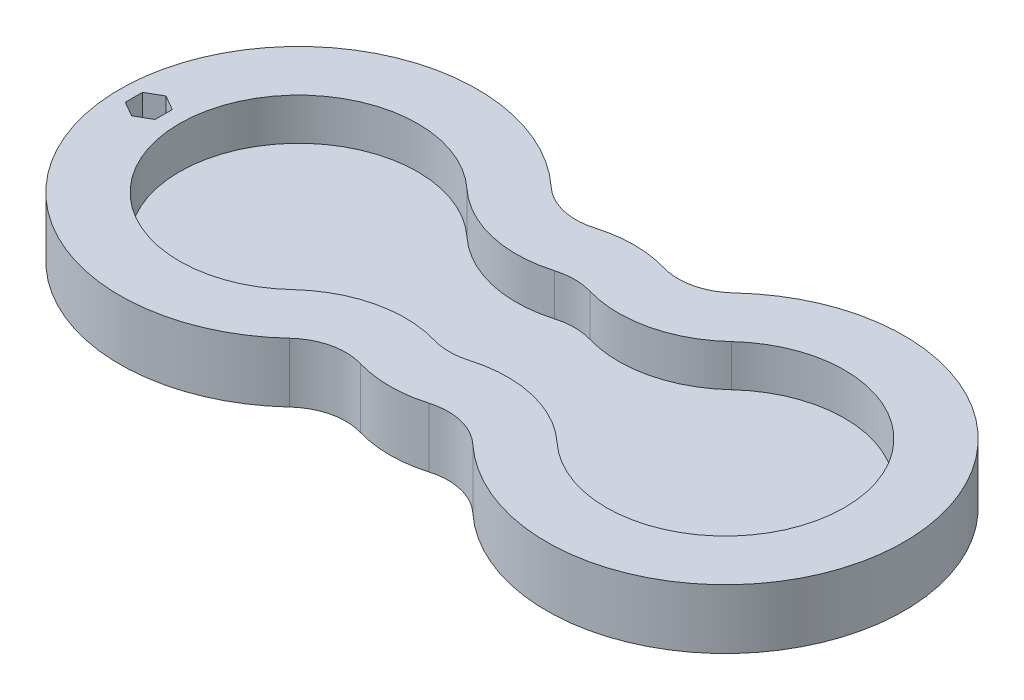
ISO-10303-21;
HEADER;
FILE_DESCRIPTION(('STEP AP214'),'2;1');
FILE_NAME('part.step','',(''),(''),'','','');
FILE_SCHEMA(('AUTOMOTIVE_DESIGN { 1 0 10303 214 1 1 1 1 }'));
ENDSEC;
DATA;
#1=APPLICATION_CONTEXT('core data for automotive mechanical design processes');
#2=APPLICATION_PROTOCOL_DEFINITION('international standard','automotive_design',2000,#1);
#3=PRODUCT_CONTEXT('',#1,'mechanical');
#4=PRODUCT('Part','Part','',(#3));
#5=PRODUCT_RELATED_PRODUCT_CATEGORY('part','',(#4));
#6=PRODUCT_DEFINITION_FORMATION('','',#4);
#7=PRODUCT_DEFINITION_CONTEXT('part definition',#1,'design');
#8=PRODUCT_DEFINITION('design','',#6,#7);
#9=PRODUCT_DEFINITION_SHAPE('','',#8);
#10=(LENGTH_UNIT() NAMED_UNIT(*) SI_UNIT(.MILLI.,.METRE.));
#11=(NAMED_UNIT(*) PLANE_ANGLE_UNIT() SI_UNIT($,.RADIAN.));
#12=(NAMED_UNIT(*) SI_UNIT($,.STERADIAN.) SOLID_ANGLE_UNIT());
#13=UNCERTAINTY_MEASURE_WITH_UNIT(LENGTH_MEASURE(1.E-05),#10,'distance_accuracy_value','');
#14=(GEOMETRIC_REPRESENTATION_CONTEXT(3) GLOBAL_UNCERTAINTY_ASSIGNED_CONTEXT((#13)) GLOBAL_UNIT_ASSIGNED_CONTEXT((#10,
#11,#12)) REPRESENTATION_CONTEXT('',''));
#15=CARTESIAN_POINT('',(0.,0.,0.));
#16=DIRECTION('',(0.,0.,1.));
#17=DIRECTION('',(1.,0.,0.));
#18=AXIS2_PLACEMENT_3D('',#15,#16,#17);
#19=CARTESIAN_POINT('',(-10.8927391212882,12.7,-37.193302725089));
#20=DIRECTION('',(0.,-1.,0.));
#21=DIRECTION('',(0.,0.,-1.));
#22=AXIS2_PLACEMENT_3D('',#19,#20,#21);
#23=CYLINDRICAL_SURFACE('',#22,12.7);
#24=CARTESIAN_POINT('',(-10.8927391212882,0.,-37.193302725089));
#25=DIRECTION('',(0.,-1.,0.));
#26=DIRECTION('',(0.,0.,-1.));
#27=AXIS2_PLACEMENT_3D('',#24,#25,#26);
#28=CIRCLE('',#27,12.7);
#29=CARTESIAN_POINT('',(-7.32324400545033,0.,-25.0052469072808));
#30=VERTEX_POINT('',#29);
#31=CARTESIAN_POINT('',(-19.5412716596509,0.,-27.893147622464));
#32=VERTEX_POINT('',#31);
#33=EDGE_CURVE('E282',#30,#32,#28,.T.);
#34=ORIENTED_EDGE('',*,*,#33,.T.);
#35=DIRECTION('',(0.,-1.,0.));
#36=VECTOR('',#35,1.);
#37=CARTESIAN_POINT('',(-19.5412716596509,12.7,-27.893147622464));
#38=LINE('',#37,#36);
#39=CARTESIAN_POINT('',(-19.5412716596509,12.7,-27.893147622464));
#40=VERTEX_POINT('',#39);
#41=EDGE_CURVE('E11',#40,#32,#38,.T.);
#42=ORIENTED_EDGE('',*,*,#41,.F.);
#43=CARTESIAN_POINT('',(-10.8927391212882,12.7,-37.193302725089));
#44=DIRECTION('',(0.,-1.,0.));
#45=DIRECTION('',(0.,0.,-1.));
#46=AXIS2_PLACEMENT_3D('',#43,#44,#45);
#47=CIRCLE('',#46,12.7);
#48=CARTESIAN_POINT('',(-7.32324400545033,12.7,-25.0052469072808));
#49=VERTEX_POINT('',#48);
#50=EDGE_CURVE('E296',#49,#40,#47,.T.);
#51=ORIENTED_EDGE('',*,*,#50,.F.);
#52=DIRECTION('',(0.,-1.,0.));
#53=VECTOR('',#52,1.);
#54=CARTESIAN_POINT('',(-7.32324400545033,12.7,-25.0052469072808));
#55=LINE('',#54,#53);
#56=EDGE_CURVE('E314',#49,#30,#55,.T.);
#57=ORIENTED_EDGE('',*,*,#56,.T.);
#58=EDGE_LOOP('',(#34,#42,#51,#57));
#59=FACE_BOUND('',#58,.T.);
#60=ADVANCED_FACE('F31',(#59),#23,.F.);
#61=CARTESIAN_POINT('',(-45.4800643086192,12.7,0.));
#62=DIRECTION('',(0.,-1.,0.));
#63=DIRECTION('',(0.,0.,-1.));
#64=AXIS2_PLACEMENT_3D('',#61,#62,#63);
#65=CYLINDRICAL_SURFACE('',#64,38.0900071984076);
#66=CARTESIAN_POINT('',(-45.4800643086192,0.,0.));
#67=DIRECTION('',(0.,1.,0.));
#68=DIRECTION('',(0.,0.,-1.));
#69=AXIS2_PLACEMENT_3D('',#66,#67,#68);
#70=CIRCLE('',#69,38.0900071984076);
#71=CARTESIAN_POINT('',(-19.5412716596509,0.,27.893147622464));
#72=VERTEX_POINT('',#71);
#73=EDGE_CURVE('E317',#32,#72,#70,.T.);
#74=ORIENTED_EDGE('',*,*,#73,.T.);
#75=DIRECTION('',(0.,-1.,0.));
#76=VECTOR('',#75,1.);
#77=CARTESIAN_POINT('',(-19.5412716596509,12.7,27.893147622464));
#78=LINE('',#77,#76);
#79=CARTESIAN_POINT('',(-19.5412716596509,12.7,27.893147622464));
#80=VERTEX_POINT('',#79);
#81=EDGE_CURVE('E38',#80,#72,#78,.T.);
#82=ORIENTED_EDGE('',*,*,#81,.F.);
#83=CARTESIAN_POINT('',(-45.4800643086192,12.7,0.));
#84=DIRECTION('',(0.,1.,0.));
#85=DIRECTION('',(0.,0.,-1.));
#86=AXIS2_PLACEMENT_3D('',#83,#84,#85);
#87=CIRCLE('',#86,38.0900071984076);
#88=EDGE_CURVE('E299',#40,#80,#87,.T.);
#89=ORIENTED_EDGE('',*,*,#88,.F.);
#90=ORIENTED_EDGE('',*,*,#41,.T.);
#91=EDGE_LOOP('',(#74,#82,#89,#90));
#92=FACE_BOUND('',#91,.T.);
#93=ADVANCED_FACE('F374',(#92),#65,.T.);
#94=CARTESIAN_POINT('',(-10.8927391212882,12.7,37.193302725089));
#95=DIRECTION('',(0.,-1.,0.));
#96=DIRECTION('',(0.,0.,-1.));
#97=AXIS2_PLACEMENT_3D('',#94,#95,#96);
#98=CYLINDRICAL_SURFACE('',#97,12.7);
#99=CARTESIAN_POINT('',(-10.8927391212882,0.,37.193302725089));
#100=DIRECTION('',(0.,-1.,0.));
#101=DIRECTION('',(0.,0.,1.));
#102=AXIS2_PLACEMENT_3D('',#99,#100,#101);
#103=CIRCLE('',#102,12.7);
#104=CARTESIAN_POINT('',(-7.32324400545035,0.,25.0052469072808));
#105=VERTEX_POINT('',#104);
#106=EDGE_CURVE('E319',#72,#105,#103,.T.);
#107=ORIENTED_EDGE('',*,*,#106,.T.);
#108=DIRECTION('',(0.,-1.,0.));
#109=VECTOR('',#108,1.);
#110=CARTESIAN_POINT('',(-7.32324400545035,12.7,25.0052469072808));
#111=LINE('',#110,#109);
#112=CARTESIAN_POINT('',(-7.32324400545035,12.7,25.0052469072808));
#113=VERTEX_POINT('',#112);
#114=EDGE_CURVE('E344',#113,#105,#111,.T.);
#115=ORIENTED_EDGE('',*,*,#114,.F.);
#116=CARTESIAN_POINT('',(-10.8927391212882,12.7,37.193302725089));
#117=DIRECTION('',(0.,-1.,0.));
#118=DIRECTION('',(0.,0.,1.));
#119=AXIS2_PLACEMENT_3D('',#116,#117,#118);
#120=CIRCLE('',#119,12.7);
#121=EDGE_CURVE('E302',#80,#113,#120,.T.);
#122=ORIENTED_EDGE('',*,*,#121,.F.);
#123=ORIENTED_EDGE('',*,*,#81,.T.);
#124=EDGE_LOOP('',(#107,#115,#122,#123));
#125=FACE_BOUND('',#124,.T.);
#126=ADVANCED_FACE('F351',(#125),#98,.F.);
#127=CARTESIAN_POINT('',(0.,12.7,0.));
#128=DIRECTION('',(0.,-1.,0.));
#129=DIRECTION('',(0.,0.,-1.));
#130=AXIS2_PLACEMENT_3D('',#127,#128,#129);
#131=CYLINDRICAL_SURFACE('',#130,26.0555613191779);
#132=CARTESIAN_POINT('',(0.,0.,0.));
#133=DIRECTION('',(0.,1.,0.));
#134=DIRECTION('',(0.,0.,1.));
#135=AXIS2_PLACEMENT_3D('',#132,#133,#134);
#136=CIRCLE('',#135,26.0555613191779);
#137=CARTESIAN_POINT('',(7.32324400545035,0.,25.0052469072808));
#138=VERTEX_POINT('',#137);
#139=EDGE_CURVE('E321',#105,#138,#136,.T.);
#140=ORIENTED_EDGE('',*,*,#139,.T.);
#141=DIRECTION('',(0.,-1.,0.));
#142=VECTOR('',#141,1.);
#143=CARTESIAN_POINT('',(7.32324400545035,12.7,25.0052469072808));
#144=LINE('',#143,#142);
#145=CARTESIAN_POINT('',(7.32324400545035,12.7,25.0052469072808));
#146=VERTEX_POINT('',#145);
#147=EDGE_CURVE('E341',#146,#138,#144,.T.);
#148=ORIENTED_EDGE('',*,*,#147,.F.);
#149=CARTESIAN_POINT('',(0.,12.7,0.));
#150=DIRECTION('',(0.,1.,0.));
#151=DIRECTION('',(0.,0.,1.));
#152=AXIS2_PLACEMENT_3D('',#149,#150,#151);
#153=CIRCLE('',#152,26.0555613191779);
#154=EDGE_CURVE('E304',#113,#146,#153,.T.);
#155=ORIENTED_EDGE('',*,*,#154,.F.);
#156=ORIENTED_EDGE('',*,*,#114,.T.);
#157=EDGE_LOOP('',(#140,#148,#155,#156));
#158=FACE_BOUND('',#157,.T.);
#159=ADVANCED_FACE('F362',(#158),#131,.T.);
#160=CARTESIAN_POINT('',(10.8927391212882,12.7,37.193302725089));
#161=DIRECTION('',(0.,-1.,0.));
#162=DIRECTION('',(0.,0.,-1.));
#163=AXIS2_PLACEMENT_3D('',#160,#161,#162);
#164=CYLINDRICAL_SURFACE('',#163,12.7);
#165=CARTESIAN_POINT('',(10.8927391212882,0.,37.193302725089));
#166=DIRECTION('',(0.,-1.,0.));
#167=DIRECTION('',(0.,0.,1.));
#168=AXIS2_PLACEMENT_3D('',#165,#166,#167);
#169=CIRCLE('',#168,12.7);
#170=CARTESIAN_POINT('',(19.5412716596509,0.,27.893147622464));
#171=VERTEX_POINT('',#170);
#172=EDGE_CURVE('E323',#138,#171,#169,.T.);
#173=ORIENTED_EDGE('',*,*,#172,.T.);
#174=DIRECTION('',(0.,-1.,0.));
#175=VECTOR('',#174,1.);
#176=CARTESIAN_POINT('',(19.5412716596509,12.7,27.893147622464));
#177=LINE('',#176,#175);
#178=CARTESIAN_POINT('',(19.5412716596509,12.7,27.893147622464));
#179=VERTEX_POINT('',#178);
#180=EDGE_CURVE('E338',#179,#171,#177,.T.);
#181=ORIENTED_EDGE('',*,*,#180,.F.);
#182=CARTESIAN_POINT('',(10.8927391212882,12.7,37.193302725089));
#183=DIRECTION('',(0.,-1.,0.));
#184=DIRECTION('',(0.,0.,1.));
#185=AXIS2_PLACEMENT_3D('',#182,#183,#184);
#186=CIRCLE('',#185,12.7);
#187=EDGE_CURVE('E306',#146,#179,#186,.T.);
#188=ORIENTED_EDGE('',*,*,#187,.F.);
#189=ORIENTED_EDGE('',*,*,#147,.T.);
#190=EDGE_LOOP('',(#173,#181,#188,#189));
#191=FACE_BOUND('',#190,.T.);
#192=ADVANCED_FACE('F366',(#191),#164,.F.);
#193=CARTESIAN_POINT('',(45.4800643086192,12.7,0.));
#194=DIRECTION('',(0.,-1.,0.));
#195=DIRECTION('',(0.,0.,-1.));
#196=AXIS2_PLACEMENT_3D('',#193,#194,#195);
#197=CYLINDRICAL_SURFACE('',#196,38.0900071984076);
#198=CARTESIAN_POINT('',(45.4800643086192,0.,0.));
#199=DIRECTION('',(0.,1.,0.));
#200=DIRECTION('',(0.,0.,1.));
#201=AXIS2_PLACEMENT_3D('',#198,#199,#200);
#202=CIRCLE('',#201,38.0900071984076);
#203=CARTESIAN_POINT('',(19.5412716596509,0.,-27.893147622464));
#204=VERTEX_POINT('',#203);
#205=EDGE_CURVE('E325',#171,#204,#202,.T.);
#206=ORIENTED_EDGE('',*,*,#205,.T.);
#207=DIRECTION('',(0.,-1.,0.));
#208=VECTOR('',#207,1.);
#209=CARTESIAN_POINT('',(19.5412716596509,12.7,-27.893147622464));
#210=LINE('',#209,#208);
#211=CARTESIAN_POINT('',(19.5412716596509,12.7,-27.893147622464));
#212=VERTEX_POINT('',#211);
#213=EDGE_CURVE('E335',#212,#204,#210,.T.);
#214=ORIENTED_EDGE('',*,*,#213,.F.);
#215=CARTESIAN_POINT('',(45.4800643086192,12.7,0.));
#216=DIRECTION('',(0.,1.,0.));
#217=DIRECTION('',(0.,0.,1.));
#218=AXIS2_PLACEMENT_3D('',#215,#216,#217);
#219=CIRCLE('',#218,38.0900071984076);
#220=EDGE_CURVE('E308',#179,#212,#219,.T.);
#221=ORIENTED_EDGE('',*,*,#220,.F.);
#222=ORIENTED_EDGE('',*,*,#180,.T.);
#223=EDGE_LOOP('',(#206,#214,#221,#222));
#224=FACE_BOUND('',#223,.T.);
#225=ADVANCED_FACE('F387',(#224),#197,.T.);
#226=CARTESIAN_POINT('',(10.8927391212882,12.7,-37.193302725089));
#227=DIRECTION('',(0.,-1.,0.));
#228=DIRECTION('',(0.,0.,-1.));
#229=AXIS2_PLACEMENT_3D('',#226,#227,#228);
#230=CYLINDRICAL_SURFACE('',#229,12.7);
#231=CARTESIAN_POINT('',(10.8927391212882,0.,-37.193302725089));
#232=DIRECTION('',(0.,-1.,0.));
#233=DIRECTION('',(0.,0.,-1.));
#234=AXIS2_PLACEMENT_3D('',#231,#232,#233);
#235=CIRCLE('',#234,12.7);
#236=CARTESIAN_POINT('',(7.32324400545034,0.,-25.0052469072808));
#237=VERTEX_POINT('',#236);
#238=EDGE_CURVE('E327',#204,#237,#235,.T.);
#239=ORIENTED_EDGE('',*,*,#238,.T.);
#240=DIRECTION('',(0.,-1.,0.));
#241=VECTOR('',#240,1.);
#242=CARTESIAN_POINT('',(7.32324400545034,12.7,-25.0052469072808));
#243=LINE('',#242,#241);
#244=CARTESIAN_POINT('',(7.32324400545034,12.7,-25.0052469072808));
#245=VERTEX_POINT('',#244);
#246=EDGE_CURVE('E332',#245,#237,#243,.T.);
#247=ORIENTED_EDGE('',*,*,#246,.F.);
#248=CARTESIAN_POINT('',(10.8927391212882,12.7,-37.193302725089));
#249=DIRECTION('',(0.,-1.,0.));
#250=DIRECTION('',(0.,0.,-1.));
#251=AXIS2_PLACEMENT_3D('',#248,#249,#250);
#252=CIRCLE('',#251,12.7);
#253=EDGE_CURVE('E310',#212,#245,#252,.T.);
#254=ORIENTED_EDGE('',*,*,#253,.F.);
#255=ORIENTED_EDGE('',*,*,#213,.T.);
#256=EDGE_LOOP('',(#239,#247,#254,#255));
#257=FACE_BOUND('',#256,.T.);
#258=ADVANCED_FACE('F385',(#257),#230,.F.);
#259=CARTESIAN_POINT('',(0.,12.7,0.));
#260=DIRECTION('',(0.,-1.,0.));
#261=DIRECTION('',(0.,0.,-1.));
#262=AXIS2_PLACEMENT_3D('',#259,#260,#261);
#263=CYLINDRICAL_SURFACE('',#262,26.0555613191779);
#264=CARTESIAN_POINT('',(0.,0.,0.));
#265=DIRECTION('',(0.,1.,0.));
#266=DIRECTION('',(0.,0.,1.));
#267=AXIS2_PLACEMENT_3D('',#264,#265,#266);
#268=CIRCLE('',#267,26.0555613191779);
#269=EDGE_CURVE('E300',#237,#30,#268,.T.);
#270=ORIENTED_EDGE('',*,*,#269,.T.);
#271=ORIENTED_EDGE('',*,*,#56,.F.);
#272=CARTESIAN_POINT('',(0.,12.7,0.));
#273=DIRECTION('',(0.,1.,0.));
#274=DIRECTION('',(0.,0.,1.));
#275=AXIS2_PLACEMENT_3D('',#272,#273,#274);
#276=CIRCLE('',#275,26.0555613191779);
#277=EDGE_CURVE('E312',#245,#49,#276,.T.);
#278=ORIENTED_EDGE('',*,*,#277,.F.);
#279=ORIENTED_EDGE('',*,*,#246,.T.);
#280=EDGE_LOOP('',(#270,#271,#278,#279));
#281=FACE_BOUND('',#280,.T.);
#282=ADVANCED_FACE('F380',(#281),#263,.T.);
#283=CARTESIAN_POINT('',(-28.1864017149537,12.7,-18.5966513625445));
#284=DIRECTION('',(0.,-1.,0.));
#285=DIRECTION('',(0.,0.,-1.));
#286=AXIS2_PLACEMENT_3D('',#283,#284,#285);
#287=PLANE('',#286);
#288=DIRECTION('',(-0.866025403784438,0.,0.500000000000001));
#289=VECTOR('',#288,1.);
#290=CARTESIAN_POINT('',(-77.3964338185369,12.7,-3.66617420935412));
#291=LINE('',#290,#289);
#292=CARTESIAN_POINT('',(-77.3964338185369,12.7,-3.66617420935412));
#293=VERTEX_POINT('',#292);
#294=CARTESIAN_POINT('',(-80.5714338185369,12.7,-1.83308710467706));
#295=VERTEX_POINT('',#294);
#296=EDGE_CURVE('E214',#293,#295,#291,.T.);
#297=ORIENTED_EDGE('',*,*,#296,.F.);
#298=DIRECTION('',(-0.866025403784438,0.,-0.500000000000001));
#299=VECTOR('',#298,1.);
#300=CARTESIAN_POINT('',(-74.221433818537,12.7,-1.83308710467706));
#301=LINE('',#300,#299);
#302=CARTESIAN_POINT('',(-74.221433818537,12.7,-1.83308710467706));
#303=VERTEX_POINT('',#302);
#304=EDGE_CURVE('E45',#303,#293,#301,.T.);
#305=ORIENTED_EDGE('',*,*,#304,.F.);
#306=DIRECTION('',(0.,0.,-1.));
#307=VECTOR('',#306,1.);
#308=CARTESIAN_POINT('',(-74.221433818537,12.7,1.83308710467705));
#309=LINE('',#308,#307);
#310=CARTESIAN_POINT('',(-74.221433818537,12.7,1.83308710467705));
#311=VERTEX_POINT('',#310);
#312=EDGE_CURVE('E200',#311,#303,#309,.T.);
#313=ORIENTED_EDGE('',*,*,#312,.F.);
#314=DIRECTION('',(0.866025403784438,0.,-0.500000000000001));
#315=VECTOR('',#314,1.);
#316=CARTESIAN_POINT('',(-77.396433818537,12.7,3.66617420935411));
#317=LINE('',#316,#315);
#318=CARTESIAN_POINT('',(-77.396433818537,12.7,3.66617420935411));
#319=VERTEX_POINT('',#318);
#320=EDGE_CURVE('E203',#319,#311,#317,.T.);
#321=ORIENTED_EDGE('',*,*,#320,.F.);
#322=DIRECTION('',(0.866025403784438,0.,0.500000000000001));
#323=VECTOR('',#322,1.);
#324=CARTESIAN_POINT('',(-80.5714338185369,12.7,1.83308710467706));
#325=LINE('',#324,#323);
#326=CARTESIAN_POINT('',(-80.5714338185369,12.7,1.83308710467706));
#327=VERTEX_POINT('',#326);
#328=EDGE_CURVE('E219',#327,#319,#325,.T.);
#329=ORIENTED_EDGE('',*,*,#328,.F.);
#330=DIRECTION('',(0.,0.,1.));
#331=VECTOR('',#330,1.);
#332=CARTESIAN_POINT('',(-80.5714338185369,12.7,-1.83308710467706));
#333=LINE('',#332,#331);
#334=EDGE_CURVE('E216',#295,#327,#333,.T.);
#335=ORIENTED_EDGE('',*,*,#334,.F.);
#336=EDGE_LOOP('',(#297,#305,#313,#321,#329,#335));
#337=FACE_BOUND('',#336,.T.);
#338=CARTESIAN_POINT('',(-10.8927391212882,12.7,37.193302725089));
#339=DIRECTION('',(0.,-1.,0.));
#340=DIRECTION('',(0.,0.,1.));
#341=AXIS2_PLACEMENT_3D('',#338,#339,#340);
#342=CIRCLE('',#341,25.4);
#343=CARTESIAN_POINT('',(-28.1898041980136,12.7,18.592992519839));
#344=VERTEX_POINT('',#343);
#345=CARTESIAN_POINT('',(-3.7537488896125,12.7,12.8171910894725));
#346=VERTEX_POINT('',#345);
#347=EDGE_CURVE('E260',#344,#346,#342,.T.);
#348=ORIENTED_EDGE('',*,*,#347,.F.);
#349=CARTESIAN_POINT('',(-45.4800643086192,12.7,0.));
#350=DIRECTION('',(0.,1.,0.));
#351=DIRECTION('',(0.,0.,1.));
#352=AXIS2_PLACEMENT_3D('',#349,#350,#351);
#353=CIRCLE('',#352,25.3900071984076);
#354=CARTESIAN_POINT('',(-28.1898041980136,12.7,-18.5929925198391));
#355=VERTEX_POINT('',#354);
#356=EDGE_CURVE('E53',#355,#344,#353,.T.);
#357=ORIENTED_EDGE('',*,*,#356,.F.);
#358=CARTESIAN_POINT('',(-10.8927391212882,12.7,-37.193302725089));
#359=DIRECTION('',(0.,-1.,0.));
#360=DIRECTION('',(0.,0.,1.));
#361=AXIS2_PLACEMENT_3D('',#358,#359,#360);
#362=CIRCLE('',#361,25.4);
#363=CARTESIAN_POINT('',(-3.75374888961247,12.7,-12.8171910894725));
#364=VERTEX_POINT('',#363);
#365=EDGE_CURVE('E237',#364,#355,#362,.T.);
#366=ORIENTED_EDGE('',*,*,#365,.F.);
#367=CARTESIAN_POINT('',(0.,12.7,0.));
#368=DIRECTION('',(0.,1.,0.));
#369=DIRECTION('',(0.,0.,1.));
#370=AXIS2_PLACEMENT_3D('',#367,#368,#369);
#371=CIRCLE('',#370,13.3555613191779);
#372=CARTESIAN_POINT('',(3.75374888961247,12.7,-12.8171910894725));
#373=VERTEX_POINT('',#372);
#374=EDGE_CURVE('E275',#373,#364,#371,.T.);
#375=ORIENTED_EDGE('',*,*,#374,.F.);
#376=CARTESIAN_POINT('',(10.8927391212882,12.7,-37.193302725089));
#377=DIRECTION('',(0.,-1.,0.));
#378=DIRECTION('',(0.,0.,1.));
#379=AXIS2_PLACEMENT_3D('',#376,#377,#378);
#380=CIRCLE('',#379,25.4);
#381=CARTESIAN_POINT('',(28.1898041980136,12.7,-18.592992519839));
#382=VERTEX_POINT('',#381);
#383=EDGE_CURVE('E272',#382,#373,#380,.T.);
#384=ORIENTED_EDGE('',*,*,#383,.F.);
#385=CARTESIAN_POINT('',(45.4800643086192,12.7,0.));
#386=DIRECTION('',(0.,1.,0.));
#387=DIRECTION('',(0.,0.,1.));
#388=AXIS2_PLACEMENT_3D('',#385,#386,#387);
#389=CIRCLE('',#388,25.3900071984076);
#390=CARTESIAN_POINT('',(28.1898041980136,12.7,18.592992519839));
#391=VERTEX_POINT('',#390);
#392=EDGE_CURVE('E269',#391,#382,#389,.T.);
#393=ORIENTED_EDGE('',*,*,#392,.F.);
#394=CARTESIAN_POINT('',(10.8927391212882,12.7,37.193302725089));
#395=DIRECTION('',(0.,-1.,0.));
#396=DIRECTION('',(0.,0.,1.));
#397=AXIS2_PLACEMENT_3D('',#394,#395,#396);
#398=CIRCLE('',#397,25.4);
#399=CARTESIAN_POINT('',(3.75374888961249,12.7,12.8171910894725));
#400=VERTEX_POINT('',#399);
#401=EDGE_CURVE('E266',#400,#391,#398,.T.);
#402=ORIENTED_EDGE('',*,*,#401,.F.);
#403=CARTESIAN_POINT('',(0.,12.7,0.));
#404=DIRECTION('',(0.,1.,0.));
#405=DIRECTION('',(0.,0.,1.));
#406=AXIS2_PLACEMENT_3D('',#403,#404,#405);
#407=CIRCLE('',#406,13.3555613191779);
#408=EDGE_CURVE('E263',#346,#400,#407,.T.);
#409=ORIENTED_EDGE('',*,*,#408,.F.);
#410=EDGE_LOOP('',(#348,#357,#366,#375,#384,#393,#402,#409));
#411=FACE_BOUND('',#410,.T.);
#412=ORIENTED_EDGE('',*,*,#50,.T.);
#413=ORIENTED_EDGE('',*,*,#88,.T.);
#414=ORIENTED_EDGE('',*,*,#121,.T.);
#415=ORIENTED_EDGE('',*,*,#154,.T.);
#416=ORIENTED_EDGE('',*,*,#187,.T.);
#417=ORIENTED_EDGE('',*,*,#220,.T.);
#418=ORIENTED_EDGE('',*,*,#253,.T.);
#419=ORIENTED_EDGE('',*,*,#277,.T.);
#420=EDGE_LOOP('',(#412,#413,#414,#415,#416,#417,#418,#419));
#421=FACE_BOUND('',#420,.T.);
#422=ADVANCED_FACE('F370',(#337,#411,#421),#287,.F.);
#423=CARTESIAN_POINT('',(-28.1864017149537,0.,-18.5966513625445));
#424=DIRECTION('',(0.,-1.,0.));
#425=DIRECTION('',(0.,0.,-1.));
#426=AXIS2_PLACEMENT_3D('',#423,#424,#425);
#427=PLANE('',#426);
#428=ORIENTED_EDGE('',*,*,#33,.F.);
#429=ORIENTED_EDGE('',*,*,#269,.F.);
#430=ORIENTED_EDGE('',*,*,#238,.F.);
#431=ORIENTED_EDGE('',*,*,#205,.F.);
#432=ORIENTED_EDGE('',*,*,#172,.F.);
#433=ORIENTED_EDGE('',*,*,#139,.F.);
#434=ORIENTED_EDGE('',*,*,#106,.F.);
#435=ORIENTED_EDGE('',*,*,#73,.F.);
#436=EDGE_LOOP('',(#428,#429,#430,#431,#432,#433,#434,#435));
#437=FACE_BOUND('',#436,.T.);
#438=ADVANCED_FACE('F357',(#437),#427,.T.);
#439=CARTESIAN_POINT('',(-45.4800643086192,3.81,0.));
#440=DIRECTION('',(0.,1.,0.));
#441=DIRECTION('',(0.,0.,1.));
#442=AXIS2_PLACEMENT_3D('',#439,#440,#441);
#443=CYLINDRICAL_SURFACE('',#442,25.3900071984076);
#444=ORIENTED_EDGE('',*,*,#356,.T.);
#445=DIRECTION('',(0.,1.,0.));
#446=VECTOR('',#445,1.);
#447=CARTESIAN_POINT('',(-28.1898041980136,3.81,18.592992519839));
#448=LINE('',#447,#446);
#449=CARTESIAN_POINT('',(-28.1898041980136,3.81,18.592992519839));
#450=VERTEX_POINT('',#449);
#451=EDGE_CURVE('E258',#450,#344,#448,.T.);
#452=ORIENTED_EDGE('',*,*,#451,.F.);
#453=CARTESIAN_POINT('',(-45.4800643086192,3.81,0.));
#454=DIRECTION('',(0.,1.,0.));
#455=DIRECTION('',(0.,0.,1.));
#456=AXIS2_PLACEMENT_3D('',#453,#454,#455);
#457=CIRCLE('',#456,25.3900071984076);
#458=CARTESIAN_POINT('',(-28.1898041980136,3.81,-18.5929925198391));
#459=VERTEX_POINT('',#458);
#460=EDGE_CURVE('E233',#459,#450,#457,.T.);
#461=ORIENTED_EDGE('',*,*,#460,.F.);
#462=DIRECTION('',(0.,1.,0.));
#463=VECTOR('',#462,1.);
#464=CARTESIAN_POINT('',(-28.1898041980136,3.81,-18.5929925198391));
#465=LINE('',#464,#463);
#466=EDGE_CURVE('E280',#459,#355,#465,.T.);
#467=ORIENTED_EDGE('',*,*,#466,.T.);
#468=EDGE_LOOP('',(#444,#452,#461,#467));
#469=FACE_BOUND('',#468,.T.);
#470=ADVANCED_FACE('F443',(#469),#443,.F.);
#471=CARTESIAN_POINT('',(-10.8927391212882,3.81,-37.193302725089));
#472=DIRECTION('',(0.,1.,0.));
#473=DIRECTION('',(0.,0.,1.));
#474=AXIS2_PLACEMENT_3D('',#471,#472,#473);
#475=CYLINDRICAL_SURFACE('',#474,25.4);
#476=ORIENTED_EDGE('',*,*,#365,.T.);
#477=ORIENTED_EDGE('',*,*,#466,.F.);
#478=CARTESIAN_POINT('',(-10.8927391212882,3.81,-37.193302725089));
#479=DIRECTION('',(0.,-1.,0.));
#480=DIRECTION('',(0.,0.,1.));
#481=AXIS2_PLACEMENT_3D('',#478,#479,#480);
#482=CIRCLE('',#481,25.4);
#483=CARTESIAN_POINT('',(-3.75374888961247,3.81,-12.8171910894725));
#484=VERTEX_POINT('',#483);
#485=EDGE_CURVE('E255',#484,#459,#482,.T.);
#486=ORIENTED_EDGE('',*,*,#485,.F.);
#487=DIRECTION('',(0.,1.,0.));
#488=VECTOR('',#487,1.);
#489=CARTESIAN_POINT('',(-3.75374888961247,3.81,-12.8171910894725));
#490=LINE('',#489,#488);
#491=EDGE_CURVE('E283',#484,#364,#490,.T.);
#492=ORIENTED_EDGE('',*,*,#491,.T.);
#493=EDGE_LOOP('',(#476,#477,#486,#492));
#494=FACE_BOUND('',#493,.T.);
#495=ADVANCED_FACE('F452',(#494),#475,.T.);
#496=CARTESIAN_POINT('',(0.,3.81,0.));
#497=DIRECTION('',(0.,1.,0.));
#498=DIRECTION('',(0.,0.,1.));
#499=AXIS2_PLACEMENT_3D('',#496,#497,#498);
#500=CYLINDRICAL_SURFACE('',#499,13.3555613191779);
#501=ORIENTED_EDGE('',*,*,#374,.T.);
#502=ORIENTED_EDGE('',*,*,#491,.F.);
#503=CARTESIAN_POINT('',(0.,3.81,0.));
#504=DIRECTION('',(0.,1.,0.));
#505=DIRECTION('',(0.,0.,1.));
#506=AXIS2_PLACEMENT_3D('',#503,#504,#505);
#507=CIRCLE('',#506,13.3555613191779);
#508=CARTESIAN_POINT('',(3.75374888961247,3.81,-12.8171910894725));
#509=VERTEX_POINT('',#508);
#510=EDGE_CURVE('E252',#509,#484,#507,.T.);
#511=ORIENTED_EDGE('',*,*,#510,.F.);
#512=DIRECTION('',(0.,1.,0.));
#513=VECTOR('',#512,1.);
#514=CARTESIAN_POINT('',(3.75374888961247,3.81,-12.8171910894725));
#515=LINE('',#514,#513);
#516=EDGE_CURVE('E285',#509,#373,#515,.T.);
#517=ORIENTED_EDGE('',*,*,#516,.T.);
#518=EDGE_LOOP('',(#501,#502,#511,#517));
#519=FACE_BOUND('',#518,.T.);
#520=ADVANCED_FACE('F461',(#519),#500,.F.);
#521=CARTESIAN_POINT('',(10.8927391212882,3.81,-37.193302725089));
#522=DIRECTION('',(0.,1.,0.));
#523=DIRECTION('',(0.,0.,1.));
#524=AXIS2_PLACEMENT_3D('',#521,#522,#523);
#525=CYLINDRICAL_SURFACE('',#524,25.4);
#526=ORIENTED_EDGE('',*,*,#383,.T.);
#527=ORIENTED_EDGE('',*,*,#516,.F.);
#528=CARTESIAN_POINT('',(10.8927391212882,3.81,-37.193302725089));
#529=DIRECTION('',(0.,-1.,0.));
#530=DIRECTION('',(0.,0.,1.));
#531=AXIS2_PLACEMENT_3D('',#528,#529,#530);
#532=CIRCLE('',#531,25.4);
#533=CARTESIAN_POINT('',(28.1898041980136,3.81,-18.592992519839));
#534=VERTEX_POINT('',#533);
#535=EDGE_CURVE('E249',#534,#509,#532,.T.);
#536=ORIENTED_EDGE('',*,*,#535,.F.);
#537=DIRECTION('',(0.,1.,0.));
#538=VECTOR('',#537,1.);
#539=CARTESIAN_POINT('',(28.1898041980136,3.81,-18.592992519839));
#540=LINE('',#539,#538);
#541=EDGE_CURVE('E287',#534,#382,#540,.T.);
#542=ORIENTED_EDGE('',*,*,#541,.T.);
#543=EDGE_LOOP('',(#526,#527,#536,#542));
#544=FACE_BOUND('',#543,.T.);
#545=ADVANCED_FACE('F471',(#544),#525,.T.);
#546=CARTESIAN_POINT('',(45.4800643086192,3.81,0.));
#547=DIRECTION('',(0.,1.,0.));
#548=DIRECTION('',(0.,0.,1.));
#549=AXIS2_PLACEMENT_3D('',#546,#547,#548);
#550=CYLINDRICAL_SURFACE('',#549,25.3900071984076);
#551=ORIENTED_EDGE('',*,*,#392,.T.);
#552=ORIENTED_EDGE('',*,*,#541,.F.);
#553=CARTESIAN_POINT('',(45.4800643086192,3.81,0.));
#554=DIRECTION('',(0.,1.,0.));
#555=DIRECTION('',(0.,0.,1.));
#556=AXIS2_PLACEMENT_3D('',#553,#554,#555);
#557=CIRCLE('',#556,25.3900071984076);
#558=CARTESIAN_POINT('',(28.1898041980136,3.81,18.592992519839));
#559=VERTEX_POINT('',#558);
#560=EDGE_CURVE('E246',#559,#534,#557,.T.);
#561=ORIENTED_EDGE('',*,*,#560,.F.);
#562=DIRECTION('',(0.,1.,0.));
#563=VECTOR('',#562,1.);
#564=CARTESIAN_POINT('',(28.1898041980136,3.81,18.592992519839));
#565=LINE('',#564,#563);
#566=EDGE_CURVE('E289',#559,#391,#565,.T.);
#567=ORIENTED_EDGE('',*,*,#566,.T.);
#568=EDGE_LOOP('',(#551,#552,#561,#567));
#569=FACE_BOUND('',#568,.T.);
#570=ADVANCED_FACE('F481',(#569),#550,.F.);
#571=CARTESIAN_POINT('',(10.8927391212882,3.81,37.193302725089));
#572=DIRECTION('',(0.,1.,0.));
#573=DIRECTION('',(0.,0.,1.));
#574=AXIS2_PLACEMENT_3D('',#571,#572,#573);
#575=CYLINDRICAL_SURFACE('',#574,25.4);
#576=ORIENTED_EDGE('',*,*,#401,.T.);
#577=ORIENTED_EDGE('',*,*,#566,.F.);
#578=CARTESIAN_POINT('',(10.8927391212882,3.81,37.193302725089));
#579=DIRECTION('',(0.,-1.,0.));
#580=DIRECTION('',(0.,0.,1.));
#581=AXIS2_PLACEMENT_3D('',#578,#579,#580);
#582=CIRCLE('',#581,25.4);
#583=CARTESIAN_POINT('',(3.75374888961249,3.81,12.8171910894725));
#584=VERTEX_POINT('',#583);
#585=EDGE_CURVE('E243',#584,#559,#582,.T.);
#586=ORIENTED_EDGE('',*,*,#585,.F.);
#587=DIRECTION('',(0.,1.,0.));
#588=VECTOR('',#587,1.);
#589=CARTESIAN_POINT('',(3.75374888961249,3.81,12.8171910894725));
#590=LINE('',#589,#588);
#591=EDGE_CURVE('E291',#584,#400,#590,.T.);
#592=ORIENTED_EDGE('',*,*,#591,.T.);
#593=EDGE_LOOP('',(#576,#577,#586,#592));
#594=FACE_BOUND('',#593,.T.);
#595=ADVANCED_FACE('F491',(#594),#575,.T.);
#596=CARTESIAN_POINT('',(0.,3.81,0.));
#597=DIRECTION('',(0.,1.,0.));
#598=DIRECTION('',(0.,0.,1.));
#599=AXIS2_PLACEMENT_3D('',#596,#597,#598);
#600=CYLINDRICAL_SURFACE('',#599,13.3555613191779);
#601=ORIENTED_EDGE('',*,*,#408,.T.);
#602=ORIENTED_EDGE('',*,*,#591,.F.);
#603=CARTESIAN_POINT('',(0.,3.81,0.));
#604=DIRECTION('',(0.,1.,0.));
#605=DIRECTION('',(0.,0.,1.));
#606=AXIS2_PLACEMENT_3D('',#603,#604,#605);
#607=CIRCLE('',#606,13.3555613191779);
#608=CARTESIAN_POINT('',(-3.7537488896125,3.81,12.8171910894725));
#609=VERTEX_POINT('',#608);
#610=EDGE_CURVE('E240',#609,#584,#607,.T.);
#611=ORIENTED_EDGE('',*,*,#610,.F.);
#612=DIRECTION('',(0.,1.,0.));
#613=VECTOR('',#612,1.);
#614=CARTESIAN_POINT('',(-3.7537488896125,3.81,12.8171910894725));
#615=LINE('',#614,#613);
#616=EDGE_CURVE('E293',#609,#346,#615,.T.);
#617=ORIENTED_EDGE('',*,*,#616,.T.);
#618=EDGE_LOOP('',(#601,#602,#611,#617));
#619=FACE_BOUND('',#618,.T.);
#620=ADVANCED_FACE('F501',(#619),#600,.F.);
#621=CARTESIAN_POINT('',(-10.8927391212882,3.81,37.193302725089));
#622=DIRECTION('',(0.,1.,0.));
#623=DIRECTION('',(0.,0.,1.));
#624=AXIS2_PLACEMENT_3D('',#621,#622,#623);
#625=CYLINDRICAL_SURFACE('',#624,25.4);
#626=ORIENTED_EDGE('',*,*,#347,.T.);
#627=ORIENTED_EDGE('',*,*,#616,.F.);
#628=CARTESIAN_POINT('',(-10.8927391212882,3.81,37.193302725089));
#629=DIRECTION('',(0.,-1.,0.));
#630=DIRECTION('',(0.,0.,1.));
#631=AXIS2_PLACEMENT_3D('',#628,#629,#630);
#632=CIRCLE('',#631,25.4);
#633=EDGE_CURVE('E236',#450,#609,#632,.T.);
#634=ORIENTED_EDGE('',*,*,#633,.F.);
#635=ORIENTED_EDGE('',*,*,#451,.T.);
#636=EDGE_LOOP('',(#626,#627,#634,#635));
#637=FACE_BOUND('',#636,.T.);
#638=ADVANCED_FACE('F511',(#637),#625,.T.);
#639=CARTESIAN_POINT('',(-28.1864017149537,3.81,18.5966513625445));
#640=DIRECTION('',(0.,1.,0.));
#641=DIRECTION('',(0.,0.,1.));
#642=AXIS2_PLACEMENT_3D('',#639,#640,#641);
#643=PLANE('',#642);
#644=ORIENTED_EDGE('',*,*,#460,.T.);
#645=ORIENTED_EDGE('',*,*,#633,.T.);
#646=ORIENTED_EDGE('',*,*,#610,.T.);
#647=ORIENTED_EDGE('',*,*,#585,.T.);
#648=ORIENTED_EDGE('',*,*,#560,.T.);
#649=ORIENTED_EDGE('',*,*,#535,.T.);
#650=ORIENTED_EDGE('',*,*,#510,.T.);
#651=ORIENTED_EDGE('',*,*,#485,.T.);
#652=EDGE_LOOP('',(#644,#645,#646,#647,#648,#649,#650,#651));
#653=FACE_BOUND('',#652,.T.);
#654=ADVANCED_FACE('F521',(#653),#643,.T.);
#655=CARTESIAN_POINT('',(-74.221433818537,7.62,-1.83308710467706));
#656=DIRECTION('',(0.500000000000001,0.,-0.866025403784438));
#657=DIRECTION('',(-0.866025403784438,0.,-0.500000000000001));
#658=AXIS2_PLACEMENT_3D('',#655,#656,#657);
#659=PLANE('',#658);
#660=ORIENTED_EDGE('',*,*,#304,.T.);
#661=DIRECTION('',(0.,1.,0.));
#662=VECTOR('',#661,1.);
#663=CARTESIAN_POINT('',(-77.3964338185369,7.62,-3.66617420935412));
#664=LINE('',#663,#662);
#665=CARTESIAN_POINT('',(-77.3964338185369,7.62,-3.66617420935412));
#666=VERTEX_POINT('',#665);
#667=EDGE_CURVE('E177',#666,#293,#664,.T.);
#668=ORIENTED_EDGE('',*,*,#667,.F.);
#669=DIRECTION('',(-0.866025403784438,0.,-0.500000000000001));
#670=VECTOR('',#669,1.);
#671=CARTESIAN_POINT('',(-74.221433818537,7.62,-1.83308710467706));
#672=LINE('',#671,#670);
#673=CARTESIAN_POINT('',(-74.221433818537,7.62,-1.83308710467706));
#674=VERTEX_POINT('',#673);
#675=EDGE_CURVE('E181',#674,#666,#672,.T.);
#676=ORIENTED_EDGE('',*,*,#675,.F.);
#677=DIRECTION('',(0.,1.,0.));
#678=VECTOR('',#677,1.);
#679=CARTESIAN_POINT('',(-74.221433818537,7.62,-1.83308710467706));
#680=LINE('',#679,#678);
#681=EDGE_CURVE('E224',#674,#303,#680,.T.);
#682=ORIENTED_EDGE('',*,*,#681,.T.);
#683=EDGE_LOOP('',(#660,#668,#676,#682));
#684=FACE_BOUND('',#683,.T.);
#685=ADVANCED_FACE('F179',(#684),#659,.F.);
#686=CARTESIAN_POINT('',(-74.221433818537,7.62,1.83308710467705));
#687=DIRECTION('',(1.,0.,0.));
#688=DIRECTION('',(0.,0.,-1.));
#689=AXIS2_PLACEMENT_3D('',#686,#687,#688);
#690=PLANE('',#689);
#691=ORIENTED_EDGE('',*,*,#312,.T.);
#692=ORIENTED_EDGE('',*,*,#681,.F.);
#693=DIRECTION('',(0.,0.,-1.));
#694=VECTOR('',#693,1.);
#695=CARTESIAN_POINT('',(-74.221433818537,7.62,1.83308710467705));
#696=LINE('',#695,#694);
#697=CARTESIAN_POINT('',(-74.221433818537,7.62,1.83308710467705));
#698=VERTEX_POINT('',#697);
#699=EDGE_CURVE('E187',#698,#674,#696,.T.);
#700=ORIENTED_EDGE('',*,*,#699,.F.);
#701=DIRECTION('',(0.,1.,0.));
#702=VECTOR('',#701,1.);
#703=CARTESIAN_POINT('',(-74.221433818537,7.62,1.83308710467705));
#704=LINE('',#703,#702);
#705=EDGE_CURVE('E226',#698,#311,#704,.T.);
#706=ORIENTED_EDGE('',*,*,#705,.T.);
#707=EDGE_LOOP('',(#691,#692,#700,#706));
#708=FACE_BOUND('',#707,.T.);
#709=ADVANCED_FACE('F547',(#708),#690,.F.);
#710=CARTESIAN_POINT('',(-77.396433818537,7.62,3.66617420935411));
#711=DIRECTION('',(0.500000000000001,0.,0.866025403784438));
#712=DIRECTION('',(0.866025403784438,0.,-0.500000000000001));
#713=AXIS2_PLACEMENT_3D('',#710,#711,#712);
#714=PLANE('',#713);
#715=ORIENTED_EDGE('',*,*,#320,.T.);
#716=ORIENTED_EDGE('',*,*,#705,.F.);
#717=DIRECTION('',(0.866025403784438,0.,-0.500000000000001));
#718=VECTOR('',#717,1.);
#719=CARTESIAN_POINT('',(-77.396433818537,7.62,3.66617420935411));
#720=LINE('',#719,#718);
#721=CARTESIAN_POINT('',(-77.396433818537,7.62,3.66617420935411));
#722=VERTEX_POINT('',#721);
#723=EDGE_CURVE('E210',#722,#698,#720,.T.);
#724=ORIENTED_EDGE('',*,*,#723,.F.);
#725=DIRECTION('',(0.,1.,0.));
#726=VECTOR('',#725,1.);
#727=CARTESIAN_POINT('',(-77.396433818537,7.62,3.66617420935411));
#728=LINE('',#727,#726);
#729=EDGE_CURVE('E228',#722,#319,#728,.T.);
#730=ORIENTED_EDGE('',*,*,#729,.T.);
#731=EDGE_LOOP('',(#715,#716,#724,#730));
#732=FACE_BOUND('',#731,.T.);
#733=ADVANCED_FACE('F556',(#732),#714,.F.);
#734=CARTESIAN_POINT('',(-80.5714338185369,7.62,1.83308710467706));
#735=DIRECTION('',(-0.500000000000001,0.,0.866025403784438));
#736=DIRECTION('',(0.866025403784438,0.,0.500000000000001));
#737=AXIS2_PLACEMENT_3D('',#734,#735,#736);
#738=PLANE('',#737);
#739=ORIENTED_EDGE('',*,*,#328,.T.);
#740=ORIENTED_EDGE('',*,*,#729,.F.);
#741=DIRECTION('',(0.866025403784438,0.,0.500000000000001));
#742=VECTOR('',#741,1.);
#743=CARTESIAN_POINT('',(-80.5714338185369,7.62,1.83308710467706));
#744=LINE('',#743,#742);
#745=CARTESIAN_POINT('',(-80.5714338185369,7.62,1.83308710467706));
#746=VERTEX_POINT('',#745);
#747=EDGE_CURVE('E207',#746,#722,#744,.T.);
#748=ORIENTED_EDGE('',*,*,#747,.F.);
#749=DIRECTION('',(0.,1.,0.));
#750=VECTOR('',#749,1.);
#751=CARTESIAN_POINT('',(-80.5714338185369,7.62,1.83308710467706));
#752=LINE('',#751,#750);
#753=EDGE_CURVE('E230',#746,#327,#752,.T.);
#754=ORIENTED_EDGE('',*,*,#753,.T.);
#755=EDGE_LOOP('',(#739,#740,#748,#754));
#756=FACE_BOUND('',#755,.T.);
#757=ADVANCED_FACE('F566',(#756),#738,.F.);
#758=CARTESIAN_POINT('',(-80.5714338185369,7.62,-1.83308710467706));
#759=DIRECTION('',(-1.,0.,0.));
#760=DIRECTION('',(0.,0.,1.));
#761=AXIS2_PLACEMENT_3D('',#758,#759,#760);
#762=PLANE('',#761);
#763=ORIENTED_EDGE('',*,*,#334,.T.);
#764=ORIENTED_EDGE('',*,*,#753,.F.);
#765=DIRECTION('',(0.,0.,1.));
#766=VECTOR('',#765,1.);
#767=CARTESIAN_POINT('',(-80.5714338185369,7.62,-1.83308710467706));
#768=LINE('',#767,#766);
#769=CARTESIAN_POINT('',(-80.5714338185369,7.62,-1.83308710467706));
#770=VERTEX_POINT('',#769);
#771=EDGE_CURVE('E195',#770,#746,#768,.T.);
#772=ORIENTED_EDGE('',*,*,#771,.F.);
#773=DIRECTION('',(0.,1.,0.));
#774=VECTOR('',#773,1.);
#775=CARTESIAN_POINT('',(-80.5714338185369,7.62,-1.83308710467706));
#776=LINE('',#775,#774);
#777=EDGE_CURVE('E186',#770,#295,#776,.T.);
#778=ORIENTED_EDGE('',*,*,#777,.T.);
#779=EDGE_LOOP('',(#763,#764,#772,#778));
#780=FACE_BOUND('',#779,.T.);
#781=ADVANCED_FACE('F576',(#780),#762,.F.);
#782=CARTESIAN_POINT('',(-77.3964338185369,7.62,-3.66617420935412));
#783=DIRECTION('',(-0.500000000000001,0.,-0.866025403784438));
#784=DIRECTION('',(-0.866025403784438,0.,0.500000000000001));
#785=AXIS2_PLACEMENT_3D('',#782,#783,#784);
#786=PLANE('',#785);
#787=ORIENTED_EDGE('',*,*,#296,.T.);
#788=ORIENTED_EDGE('',*,*,#777,.F.);
#789=DIRECTION('',(-0.866025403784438,0.,0.500000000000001));
#790=VECTOR('',#789,1.);
#791=CARTESIAN_POINT('',(-77.3964338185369,7.62,-3.66617420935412));
#792=LINE('',#791,#790);
#793=EDGE_CURVE('E190',#666,#770,#792,.T.);
#794=ORIENTED_EDGE('',*,*,#793,.F.);
#795=ORIENTED_EDGE('',*,*,#667,.T.);
#796=EDGE_LOOP('',(#787,#788,#794,#795));
#797=FACE_BOUND('',#796,.T.);
#798=ADVANCED_FACE('F191',(#797),#786,.F.);
#799=CARTESIAN_POINT('',(-77.3964338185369,7.62,-3.66617420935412));
#800=DIRECTION('',(0.,1.,0.));
#801=DIRECTION('',(0.,0.,1.));
#802=AXIS2_PLACEMENT_3D('',#799,#800,#801);
#803=PLANE('',#802);
#804=ORIENTED_EDGE('',*,*,#675,.T.);
#805=ORIENTED_EDGE('',*,*,#793,.T.);
#806=ORIENTED_EDGE('',*,*,#771,.T.);
#807=ORIENTED_EDGE('',*,*,#747,.T.);
#808=ORIENTED_EDGE('',*,*,#723,.T.);
#809=ORIENTED_EDGE('',*,*,#699,.T.);
#810=EDGE_LOOP('',(#804,#805,#806,#807,#808,#809));
#811=FACE_BOUND('',#810,.T.);
#812=ADVANCED_FACE('F197',(#811),#803,.T.);
#813=CLOSED_SHELL('',(#60,#93,#126,#159,#192,#225,#258,#282,#422,#438,#470,#495,#520,#545,#570,
#595,#620,#638,#654,#685,#709,#733,#757,#781,#798,#812));
#814=MANIFOLD_SOLID_BREP('B2',#813);
#815=ADVANCED_BREP_SHAPE_REPRESENTATION('',(#18,#814),#14);
#816=SHAPE_DEFINITION_REPRESENTATION(#9,#815);
ENDSEC;
END-ISO-10303-21;
